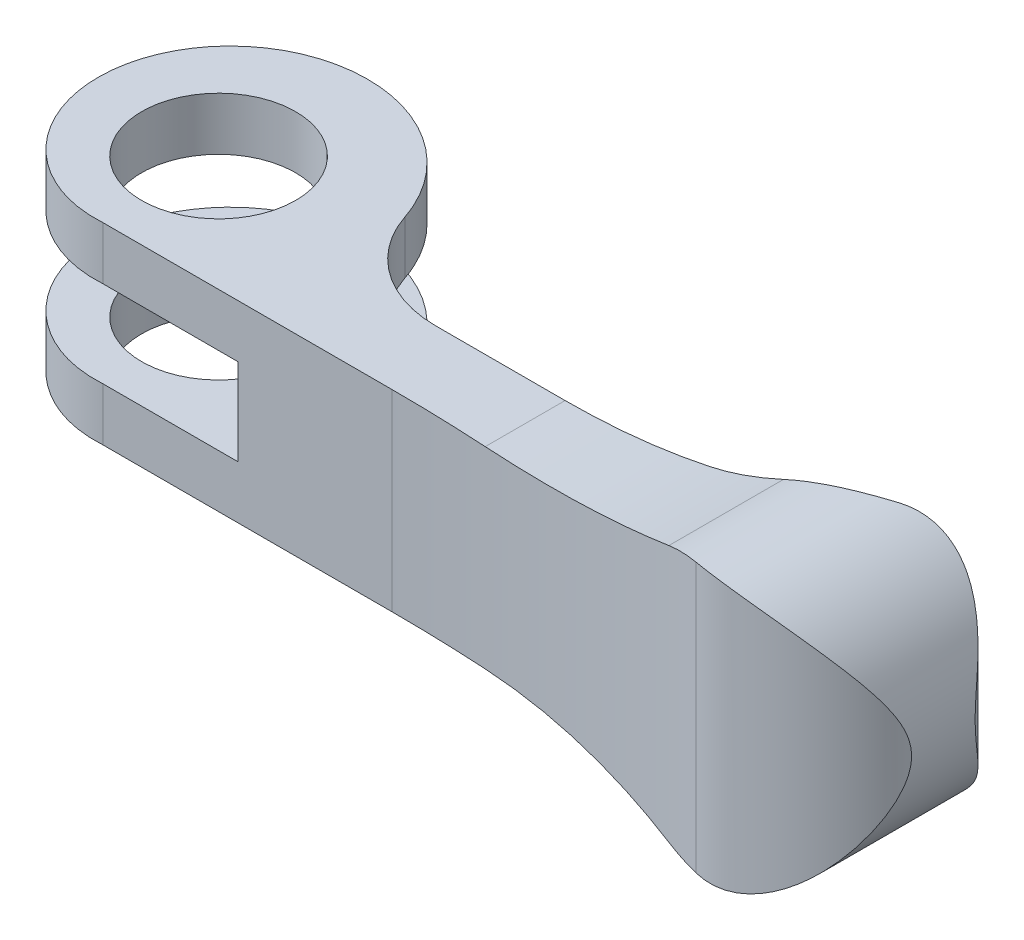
ISO-10303-21;
HEADER;
FILE_DESCRIPTION(('STEP AP214'),'2;1');
FILE_NAME('part.step','',(''),(''),'','','');
FILE_SCHEMA(('AUTOMOTIVE_DESIGN { 1 0 10303 214 1 1 1 1 }'));
ENDSEC;
DATA;
#1=APPLICATION_CONTEXT('core data for automotive mechanical design processes');
#2=APPLICATION_PROTOCOL_DEFINITION('international standard','automotive_design',2000,#1);
#3=PRODUCT_CONTEXT('',#1,'mechanical');
#4=PRODUCT('Part','Part','',(#3));
#5=PRODUCT_RELATED_PRODUCT_CATEGORY('part','',(#4));
#6=PRODUCT_DEFINITION_FORMATION('','',#4);
#7=PRODUCT_DEFINITION_CONTEXT('part definition',#1,'design');
#8=PRODUCT_DEFINITION('design','',#6,#7);
#9=PRODUCT_DEFINITION_SHAPE('','',#8);
#10=(LENGTH_UNIT() NAMED_UNIT(*) SI_UNIT(.MILLI.,.METRE.));
#11=(NAMED_UNIT(*) PLANE_ANGLE_UNIT() SI_UNIT($,.RADIAN.));
#12=(NAMED_UNIT(*) SI_UNIT($,.STERADIAN.) SOLID_ANGLE_UNIT());
#13=UNCERTAINTY_MEASURE_WITH_UNIT(LENGTH_MEASURE(1.E-05),#10,'distance_accuracy_value','');
#14=(GEOMETRIC_REPRESENTATION_CONTEXT(3) GLOBAL_UNCERTAINTY_ASSIGNED_CONTEXT((#13)) GLOBAL_UNIT_ASSIGNED_CONTEXT((#10,
#11,#12)) REPRESENTATION_CONTEXT('',''));
#15=CARTESIAN_POINT('',(0.,0.,0.));
#16=DIRECTION('',(0.,0.,1.));
#17=DIRECTION('',(1.,0.,0.));
#18=AXIS2_PLACEMENT_3D('',#15,#16,#17);
#19=CARTESIAN_POINT('',(15.,-7.,90.75));
#20=DIRECTION('',(0.,1.,0.));
#21=DIRECTION('',(1.,0.,0.));
#22=AXIS2_PLACEMENT_3D('',#19,#20,#21);
#23=CYLINDRICAL_SURFACE('',#22,84.75);
#24=CARTESIAN_POINT('',(30.8959537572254,6.67630057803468,7.50409226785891));
#25=CARTESIAN_POINT('',(31.0384123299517,6.72120307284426,7.53129297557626));
#26=CARTESIAN_POINT('',(31.182197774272,6.76149824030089,7.5591300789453));
#27=CARTESIAN_POINT('',(31.4712555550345,6.83264115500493,7.61588085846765));
#28=CARTESIAN_POINT('',(31.6165197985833,6.86352550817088,7.64478985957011));
#29=CARTESIAN_POINT('',(31.9084994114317,6.91596904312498,7.70370371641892));
#30=CARTESIAN_POINT('',(32.0552147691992,6.93752829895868,7.7337085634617));
#31=CARTESIAN_POINT('',(32.3500956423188,6.97135251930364,7.79483420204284));
#32=CARTESIAN_POINT('',(32.498264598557,6.98358037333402,7.82595893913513));
#33=CARTESIAN_POINT('',(32.6465753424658,6.99107223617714,7.85753424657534));
#34=B_SPLINE_CURVE_WITH_KNOTS('',3,(#24,#25,#26,#27,#28,#29,#30,#31,#32,#33),.UNSPECIFIED.,.F.,
.F.,(4,2,2,2,4),(0.,0.455390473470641,0.908986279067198,1.36257848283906,1.8179653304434),.UNSPECIFIED.);
#35=CARTESIAN_POINT('',(30.8959537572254,6.67630057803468,7.50409226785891));
#36=VERTEX_POINT('',#35);
#37=CARTESIAN_POINT('',(32.6465753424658,6.99107223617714,7.85753424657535));
#38=VERTEX_POINT('',#37);
#39=EDGE_CURVE('E179',#36,#38,#34,.T.);
#40=ORIENTED_EDGE('',*,*,#39,.F.);
#41=CARTESIAN_POINT('',(20.,5.,6.14762119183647));
#42=CARTESIAN_POINT('',(20.4656564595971,4.99999748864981,6.17513663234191));
#43=CARTESIAN_POINT('',(20.9310331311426,5.00897368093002,6.20650412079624));
#44=CARTESIAN_POINT('',(21.860510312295,5.04478911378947,6.2768504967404));
#45=CARTESIAN_POINT('',(22.3246108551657,5.0716278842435,6.31582918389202));
#46=CARTESIAN_POINT('',(23.7076390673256,5.17830965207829,6.44346213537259));
#47=CARTESIAN_POINT('',(24.6236680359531,5.28432229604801,6.54319205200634));
#48=CARTESIAN_POINT('',(26.4414941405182,5.56505184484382,6.77087232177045));
#49=CARTESIAN_POINT('',(27.3432919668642,5.73976540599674,6.89882130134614));
#50=CARTESIAN_POINT('',(28.6840028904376,6.05251039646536,7.11078996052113));
#51=CARTESIAN_POINT('',(29.1304089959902,6.16567755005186,7.18507473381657));
#52=CARTESIAN_POINT('',(30.0175613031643,6.40861020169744,7.33993963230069));
#53=CARTESIAN_POINT('',(30.4583077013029,6.53837512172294,7.42051953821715));
#54=CARTESIAN_POINT('',(30.8959537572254,6.67630057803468,7.50409226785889));
#55=B_SPLINE_CURVE_WITH_KNOTS('',3,(#41,#42,#43,#44,#45,#46,#47,#48,#49,#50,#51,#52,#53,#54),
.UNSPECIFIED.,.F.,.F.,(4,2,2,2,2,2,4),(0.,1.39920156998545,2.7983663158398,5.57759832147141,
8.35669507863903,9.7558093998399,11.1548750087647),.UNSPECIFIED.);
#56=CARTESIAN_POINT('',(20.,5.,6.14762119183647));
#57=VERTEX_POINT('',#56);
#58=EDGE_CURVE('E145',#57,#36,#55,.T.);
#59=ORIENTED_EDGE('',*,*,#58,.F.);
#60=CARTESIAN_POINT('',(15.,5.,90.75));
#61=DIRECTION('',(0.,1.,0.));
#62=DIRECTION('',(1.,0.,0.));
#63=AXIS2_PLACEMENT_3D('',#60,#61,#62);
#64=CIRCLE('',#63,84.75);
#65=CARTESIAN_POINT('',(15.,5.,6.));
#66=VERTEX_POINT('',#65);
#67=EDGE_CURVE('E154',#66,#57,#64,.F.);
#68=ORIENTED_EDGE('',*,*,#67,.F.);
#69=DIRECTION('',(0.,1.,0.));
#70=VECTOR('',#69,1.);
#71=CARTESIAN_POINT('',(15.,-7.,6.));
#72=LINE('',#71,#70);
#73=CARTESIAN_POINT('',(15.,-5.,6.));
#74=VERTEX_POINT('',#73);
#75=EDGE_CURVE('E303',#74,#66,#72,.T.);
#76=ORIENTED_EDGE('',*,*,#75,.F.);
#77=CARTESIAN_POINT('',(15.,-5.,90.75));
#78=DIRECTION('',(0.,1.,0.));
#79=DIRECTION('',(1.,0.,0.));
#80=AXIS2_PLACEMENT_3D('',#77,#78,#79);
#81=CIRCLE('',#80,84.75);
#82=CARTESIAN_POINT('',(20.,-5.,6.14762119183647));
#83=VERTEX_POINT('',#82);
#84=EDGE_CURVE('E558',#74,#83,#81,.F.);
#85=ORIENTED_EDGE('',*,*,#84,.T.);
#86=CARTESIAN_POINT('',(20.,-5.,6.14762119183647));
#87=CARTESIAN_POINT('',(20.4656564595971,-4.99999748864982,6.17513663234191));
#88=CARTESIAN_POINT('',(20.9310331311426,-5.00897368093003,6.20650412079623));
#89=CARTESIAN_POINT('',(21.860510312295,-5.04478911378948,6.27685049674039));
#90=CARTESIAN_POINT('',(22.3246108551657,-5.07162788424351,6.31582918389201));
#91=CARTESIAN_POINT('',(23.7076390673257,-5.1783096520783,6.44346213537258));
#92=CARTESIAN_POINT('',(24.6236680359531,-5.28432229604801,6.54319205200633));
#93=CARTESIAN_POINT('',(26.4414941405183,-5.56505184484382,6.77087232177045));
#94=CARTESIAN_POINT('',(27.3432919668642,-5.73976540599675,6.89882130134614));
#95=CARTESIAN_POINT('',(28.6840028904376,-6.05251039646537,7.11078996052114));
#96=CARTESIAN_POINT('',(29.1304089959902,-6.16567755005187,7.18507473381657));
#97=CARTESIAN_POINT('',(30.0175613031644,-6.40861020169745,7.33993963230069));
#98=CARTESIAN_POINT('',(30.4583077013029,-6.53837512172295,7.42051953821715));
#99=CARTESIAN_POINT('',(30.8959537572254,-6.67630057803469,7.50409226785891));
#100=B_SPLINE_CURVE_WITH_KNOTS('',3,(#86,#87,#88,#89,#90,#91,#92,#93,#94,#95,#96,#97,#98,#99),
.UNSPECIFIED.,.F.,.F.,(4,2,2,2,2,2,4),(0.,1.39920156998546,2.79836631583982,5.57759832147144,
8.35669507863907,9.75580939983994,11.1548750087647),.UNSPECIFIED.);
#101=CARTESIAN_POINT('',(30.8959537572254,-6.67630057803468,7.50409226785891));
#102=VERTEX_POINT('',#101);
#103=EDGE_CURVE('E541',#83,#102,#100,.T.);
#104=ORIENTED_EDGE('',*,*,#103,.T.);
#105=CARTESIAN_POINT('',(30.8959537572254,-6.67630057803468,7.50409226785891));
#106=CARTESIAN_POINT('',(31.0384123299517,-6.72120307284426,7.53129297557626));
#107=CARTESIAN_POINT('',(31.182197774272,-6.76149824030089,7.5591300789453));
#108=CARTESIAN_POINT('',(31.4712555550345,-6.83264115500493,7.61588085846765));
#109=CARTESIAN_POINT('',(31.6165197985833,-6.86352550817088,7.64478985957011));
#110=CARTESIAN_POINT('',(31.9084994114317,-6.91596904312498,7.70370371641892));
#111=CARTESIAN_POINT('',(32.0552147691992,-6.93752829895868,7.7337085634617));
#112=CARTESIAN_POINT('',(32.3500956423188,-6.97135251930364,7.79483420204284));
#113=CARTESIAN_POINT('',(32.498264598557,-6.98358037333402,7.82595893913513));
#114=CARTESIAN_POINT('',(32.6465753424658,-6.99107223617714,7.85753424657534));
#115=B_SPLINE_CURVE_WITH_KNOTS('',3,(#105,#106,#107,#108,#109,#110,#111,#112,#113,#114),
.UNSPECIFIED.,.F.,.F.,(4,2,2,2,4),(0.,0.455390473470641,0.908986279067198,1.36257848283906,
1.8179653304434),.UNSPECIFIED.);
#116=CARTESIAN_POINT('',(32.6465753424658,-6.99107223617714,7.85753424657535));
#117=VERTEX_POINT('',#116);
#118=EDGE_CURVE('E222',#102,#117,#115,.T.);
#119=ORIENTED_EDGE('',*,*,#118,.T.);
#120=DIRECTION('',(0.,1.,0.));
#121=VECTOR('',#120,1.);
#122=CARTESIAN_POINT('',(32.6465753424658,-7.,7.85753424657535));
#123=LINE('',#122,#121);
#124=EDGE_CURVE('E286',#117,#38,#123,.T.);
#125=ORIENTED_EDGE('',*,*,#124,.T.);
#126=EDGE_LOOP('',(#40,#59,#68,#76,#85,#104,#119,#125));
#127=FACE_BOUND('',#126,.T.);
#128=ADVANCED_FACE('F14',(#127),#23,.F.);
#129=CARTESIAN_POINT('',(0.,-7.,6.));
#130=DIRECTION('',(0.,0.,-1.));
#131=DIRECTION('',(1.,0.,0.));
#132=AXIS2_PLACEMENT_3D('',#129,#130,#131);
#133=PLANE('',#132);
#134=DIRECTION('',(1.,0.,0.));
#135=VECTOR('',#134,1.);
#136=CARTESIAN_POINT('',(0.,5.,6.));
#137=LINE('',#136,#135);
#138=CARTESIAN_POINT('',(0.,5.,6.));
#139=VERTEX_POINT('',#138);
#140=EDGE_CURVE('E164',#139,#66,#137,.T.);
#141=ORIENTED_EDGE('',*,*,#140,.F.);
#142=DIRECTION('',(0.,1.,0.));
#143=VECTOR('',#142,1.);
#144=CARTESIAN_POINT('',(0.,-7.,6.));
#145=LINE('',#144,#143);
#146=CARTESIAN_POINT('',(0.,2.25,6.));
#147=VERTEX_POINT('',#146);
#148=EDGE_CURVE('E294',#147,#139,#145,.T.);
#149=ORIENTED_EDGE('',*,*,#148,.F.);
#150=DIRECTION('',(1.,0.,0.));
#151=VECTOR('',#150,1.);
#152=CARTESIAN_POINT('',(0.,2.25,6.));
#153=LINE('',#152,#151);
#154=CARTESIAN_POINT('',(7.,2.25,6.));
#155=VERTEX_POINT('',#154);
#156=EDGE_CURVE('E42',#147,#155,#153,.T.);
#157=ORIENTED_EDGE('',*,*,#156,.T.);
#158=DIRECTION('',(0.,-1.,0.));
#159=VECTOR('',#158,1.);
#160=CARTESIAN_POINT('',(7.,-7.,6.));
#161=LINE('',#160,#159);
#162=CARTESIAN_POINT('',(7.,-2.25,6.));
#163=VERTEX_POINT('',#162);
#164=EDGE_CURVE('E367',#155,#163,#161,.T.);
#165=ORIENTED_EDGE('',*,*,#164,.T.);
#166=DIRECTION('',(-1.,0.,0.));
#167=VECTOR('',#166,1.);
#168=CARTESIAN_POINT('',(0.,-2.25,6.));
#169=LINE('',#168,#167);
#170=CARTESIAN_POINT('',(0.,-2.25,6.));
#171=VERTEX_POINT('',#170);
#172=EDGE_CURVE('E361',#163,#171,#169,.T.);
#173=ORIENTED_EDGE('',*,*,#172,.T.);
#174=CARTESIAN_POINT('',(0.,-5.,6.));
#175=VERTEX_POINT('',#174);
#176=EDGE_CURVE('E298',#175,#171,#145,.T.);
#177=ORIENTED_EDGE('',*,*,#176,.F.);
#178=DIRECTION('',(1.,0.,0.));
#179=VECTOR('',#178,1.);
#180=CARTESIAN_POINT('',(0.,-5.,6.));
#181=LINE('',#180,#179);
#182=EDGE_CURVE('E543',#175,#74,#181,.T.);
#183=ORIENTED_EDGE('',*,*,#182,.T.);
#184=ORIENTED_EDGE('',*,*,#75,.T.);
#185=EDGE_LOOP('',(#141,#149,#157,#165,#173,#177,#183,#184));
#186=FACE_BOUND('',#185,.T.);
#187=ADVANCED_FACE('F274',(#186),#133,.F.);
#188=CARTESIAN_POINT('',(0.,-7.,6.));
#189=CARTESIAN_POINT('',(-0.785398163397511,-7.,6.05491666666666));
#190=CARTESIAN_POINT('',(-1.59259457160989,-7.,5.95356167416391));
#191=CARTESIAN_POINT('',(-3.12570080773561,-7.,5.43741102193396));
#192=CARTESIAN_POINT('',(-3.85094151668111,-7.,5.02265933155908));
#193=CARTESIAN_POINT('',(-5.10032322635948,-7.,3.92860541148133));
#194=CARTESIAN_POINT('',(-5.6238508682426,-7.,3.24961186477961));
#195=CARTESIAN_POINT('',(-6.3759584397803,-7.,1.72087189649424));
#196=CARTESIAN_POINT('',(-6.60408333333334,-7.,0.871661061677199));
#197=CARTESIAN_POINT('',(-6.71391666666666,-7.,-0.871661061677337));
#198=CARTESIAN_POINT('',(-6.59540966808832,-7.,-1.76508642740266));
#199=CARTESIAN_POINT('',(-6.01323625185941,-7.,-3.45758571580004));
#200=CARTESIAN_POINT('',(-5.54963978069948,-7.,-4.25592780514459));
#201=CARTESIAN_POINT('',(-4.33359169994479,-7.,-5.62730367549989));
#202=CARTESIAN_POINT('',(-3.58149677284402,-7.,-6.19967609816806));
#203=CARTESIAN_POINT('',(-1.893363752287,-7.,-7.01780643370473));
#204=CARTESIAN_POINT('',(-0.957923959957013,-7.,-7.26308333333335));
#205=CARTESIAN_POINT('',(0.957923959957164,-7.,-7.37291666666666));
#206=CARTESIAN_POINT('',(1.93757828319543,-7.,-7.23725766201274));
#207=CARTESIAN_POINT('',(3.78947062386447,-7.,-6.58906148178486));
#208=CARTESIAN_POINT('',(4.66091409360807,-7.,-6.07662022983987));
#209=CARTESIAN_POINT('',(6.1542841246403,-7.,-4.73857798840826));
#210=CARTESIAN_POINT('',(6.77550132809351,-7.,-3.91338168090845));
#211=CARTESIAN_POINT('',(7.65965442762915,-7.,-2.06585560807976));
#212=CARTESIAN_POINT('',(7.92208333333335,-7.,-1.04418685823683));
#213=CARTESIAN_POINT('',(8.03191666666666,-7.,1.04418685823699));
#214=CARTESIAN_POINT('',(7.87910565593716,-7.,2.1100701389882));
#215=CARTESIAN_POINT('',(7.16488671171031,-7.,4.1213555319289));
#216=CARTESIAN_POINT('',(6.60360067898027,-7.,5.06590038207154));
#217=CARTESIAN_POINT('',(5.14356427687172,-7.,6.6812645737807));
#218=CARTESIAN_POINT('',(4.24526658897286,-7.,7.35132655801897));
#219=CARTESIAN_POINT('',(2.23834746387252,-7.,8.30150242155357));
#220=CARTESIAN_POINT('',(1.13044975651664,-7.,8.58108333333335));
#221=CARTESIAN_POINT('',(0.,-7.,8.636));
#222=B_SPLINE_CURVE_WITH_KNOTS('',3,(#188,#189,#190,#191,#192,#193,#194,#195,#196,#197,#198,
#199,#200,#201,#202,#203,#204,#205,#206,#207,#208,#209,#210,#211,#212,#213,#214,#215,#216,#217,
#218,#219,#220,#221),.UNSPECIFIED.,.F.,.F.,(4,2,2,2,2,2,2,2,2,2,2,2,2,2,2,2,4),(0.,0.0625,0.125,
0.1875,0.25,0.3125,0.375,0.4375,0.5,0.5625,0.625,0.6875,0.75,0.8125,0.875,0.9375,1.),.UNSPECIFIED.);
#223=DIRECTION('',(0.,1.,0.));
#224=VECTOR('',#223,1.);
#225=SURFACE_OF_LINEAR_EXTRUSION('',#222,#224);
#226=CARTESIAN_POINT('',(0.,5.,6.));
#227=CARTESIAN_POINT('',(-0.785398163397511,5.,6.05491666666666));
#228=CARTESIAN_POINT('',(-1.59259457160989,5.,5.95356167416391));
#229=CARTESIAN_POINT('',(-3.12570080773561,5.,5.43741102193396));
#230=CARTESIAN_POINT('',(-3.85094151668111,5.,5.02265933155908));
#231=CARTESIAN_POINT('',(-5.10032322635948,5.,3.92860541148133));
#232=CARTESIAN_POINT('',(-5.6238508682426,5.,3.24961186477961));
#233=CARTESIAN_POINT('',(-6.3759584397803,5.,1.72087189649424));
#234=CARTESIAN_POINT('',(-6.60408333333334,5.,0.871661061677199));
#235=CARTESIAN_POINT('',(-6.71391666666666,5.,-0.871661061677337));
#236=CARTESIAN_POINT('',(-6.59540966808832,5.,-1.76508642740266));
#237=CARTESIAN_POINT('',(-6.01323625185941,5.,-3.45758571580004));
#238=CARTESIAN_POINT('',(-5.54963978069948,5.,-4.25592780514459));
#239=CARTESIAN_POINT('',(-4.33359169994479,5.,-5.62730367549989));
#240=CARTESIAN_POINT('',(-3.58149677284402,5.,-6.19967609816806));
#241=CARTESIAN_POINT('',(-1.893363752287,5.,-7.01780643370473));
#242=CARTESIAN_POINT('',(-0.957923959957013,5.,-7.26308333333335));
#243=CARTESIAN_POINT('',(0.957923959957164,5.,-7.37291666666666));
#244=CARTESIAN_POINT('',(1.93757828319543,5.,-7.23725766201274));
#245=CARTESIAN_POINT('',(3.78947062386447,5.,-6.58906148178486));
#246=CARTESIAN_POINT('',(4.66091409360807,5.,-6.07662022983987));
#247=CARTESIAN_POINT('',(6.1542841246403,5.,-4.73857798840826));
#248=CARTESIAN_POINT('',(6.77550132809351,5.,-3.91338168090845));
#249=CARTESIAN_POINT('',(7.65965442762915,5.,-2.06585560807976));
#250=CARTESIAN_POINT('',(7.92208333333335,5.,-1.04418685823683));
#251=CARTESIAN_POINT('',(8.03191666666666,5.,1.04418685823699));
#252=CARTESIAN_POINT('',(7.87910565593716,5.,2.1100701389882));
#253=CARTESIAN_POINT('',(7.16488671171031,5.,4.1213555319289));
#254=CARTESIAN_POINT('',(6.60360067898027,5.,5.06590038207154));
#255=CARTESIAN_POINT('',(5.14356427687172,5.,6.6812645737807));
#256=CARTESIAN_POINT('',(4.24526658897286,5.,7.35132655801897));
#257=CARTESIAN_POINT('',(2.23834746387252,5.,8.30150242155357));
#258=CARTESIAN_POINT('',(1.13044975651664,5.,8.58108333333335));
#259=CARTESIAN_POINT('',(0.,5.,8.636));
#260=B_SPLINE_CURVE_WITH_KNOTS('',3,(#226,#227,#228,#229,#230,#231,#232,#233,#234,#235,#236,
#237,#238,#239,#240,#241,#242,#243,#244,#245,#246,#247,#248,#249,#250,#251,#252,#253,#254,#255,
#256,#257,#258,#259),.UNSPECIFIED.,.F.,.F.,(4,2,2,2,2,2,2,2,2,2,2,2,2,2,2,2,4),(0.,0.0625,0.125,
0.1875,0.25,0.3125,0.375,0.4375,0.5,0.5625,0.625,0.6875,0.75,0.8125,0.875,0.9375,1.),.UNSPECIFIED.);
#261=CARTESIAN_POINT('',(7.57871796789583,5.,-2.09668552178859));
#262=VERTEX_POINT('',#261);
#263=EDGE_CURVE('E162',#262,#139,#260,.F.);
#264=ORIENTED_EDGE('',*,*,#263,.F.);
#265=DIRECTION('',(0.,1.,0.));
#266=VECTOR('',#265,1.);
#267=CARTESIAN_POINT('',(7.57871796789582,7.,-2.09668552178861));
#268=LINE('',#267,#266);
#269=CARTESIAN_POINT('',(7.57871796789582,2.25,-2.09668552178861));
#270=VERTEX_POINT('',#269);
#271=EDGE_CURVE('E35',#262,#270,#268,.F.);
#272=ORIENTED_EDGE('',*,*,#271,.T.);
#273=CARTESIAN_POINT('',(0.,2.25,6.));
#274=CARTESIAN_POINT('',(-0.785398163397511,2.25,6.05491666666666));
#275=CARTESIAN_POINT('',(-1.59259457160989,2.25,5.95356167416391));
#276=CARTESIAN_POINT('',(-3.12570080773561,2.25,5.43741102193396));
#277=CARTESIAN_POINT('',(-3.85094151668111,2.25,5.02265933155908));
#278=CARTESIAN_POINT('',(-5.10032322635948,2.25,3.92860541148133));
#279=CARTESIAN_POINT('',(-5.6238508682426,2.25,3.24961186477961));
#280=CARTESIAN_POINT('',(-6.3759584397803,2.25,1.72087189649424));
#281=CARTESIAN_POINT('',(-6.60408333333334,2.25,0.871661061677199));
#282=CARTESIAN_POINT('',(-6.71391666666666,2.25,-0.871661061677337));
#283=CARTESIAN_POINT('',(-6.59540966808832,2.25,-1.76508642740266));
#284=CARTESIAN_POINT('',(-6.01323625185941,2.25,-3.45758571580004));
#285=CARTESIAN_POINT('',(-5.54963978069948,2.25,-4.25592780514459));
#286=CARTESIAN_POINT('',(-4.33359169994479,2.25,-5.62730367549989));
#287=CARTESIAN_POINT('',(-3.58149677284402,2.25,-6.19967609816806));
#288=CARTESIAN_POINT('',(-1.893363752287,2.25,-7.01780643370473));
#289=CARTESIAN_POINT('',(-0.957923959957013,2.25,-7.26308333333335));
#290=CARTESIAN_POINT('',(0.957923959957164,2.25,-7.37291666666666));
#291=CARTESIAN_POINT('',(1.93757828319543,2.25,-7.23725766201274));
#292=CARTESIAN_POINT('',(3.78947062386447,2.25,-6.58906148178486));
#293=CARTESIAN_POINT('',(4.66091409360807,2.25,-6.07662022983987));
#294=CARTESIAN_POINT('',(6.1542841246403,2.25,-4.73857798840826));
#295=CARTESIAN_POINT('',(6.77550132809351,2.25,-3.91338168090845));
#296=CARTESIAN_POINT('',(7.65965442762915,2.25,-2.06585560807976));
#297=CARTESIAN_POINT('',(7.92208333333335,2.25,-1.04418685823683));
#298=CARTESIAN_POINT('',(8.03191666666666,2.25,1.04418685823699));
#299=CARTESIAN_POINT('',(7.87910565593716,2.25,2.1100701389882));
#300=CARTESIAN_POINT('',(7.16488671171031,2.25,4.1213555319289));
#301=CARTESIAN_POINT('',(6.60360067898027,2.25,5.06590038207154));
#302=CARTESIAN_POINT('',(5.14356427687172,2.25,6.6812645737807));
#303=CARTESIAN_POINT('',(4.24526658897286,2.25,7.35132655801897));
#304=CARTESIAN_POINT('',(2.23834746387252,2.25,8.30150242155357));
#305=CARTESIAN_POINT('',(1.13044975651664,2.25,8.58108333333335));
#306=CARTESIAN_POINT('',(0.,2.25,8.636));
#307=B_SPLINE_CURVE_WITH_KNOTS('',3,(#273,#274,#275,#276,#277,#278,#279,#280,#281,#282,#283,
#284,#285,#286,#287,#288,#289,#290,#291,#292,#293,#294,#295,#296,#297,#298,#299,#300,#301,#302,
#303,#304,#305,#306),.UNSPECIFIED.,.F.,.F.,(4,2,2,2,2,2,2,2,2,2,2,2,2,2,2,2,4),(0.,0.0625,0.125,
0.1875,0.25,0.3125,0.375,0.4375,0.5,0.5625,0.625,0.6875,0.75,0.8125,0.875,0.9375,1.),.UNSPECIFIED.);
#308=EDGE_CURVE('E309',#270,#147,#307,.F.);
#309=ORIENTED_EDGE('',*,*,#308,.T.);
#310=ORIENTED_EDGE('',*,*,#148,.T.);
#311=EDGE_LOOP('',(#264,#272,#309,#310));
#312=FACE_BOUND('',#311,.T.);
#313=ADVANCED_FACE('F280',(#312),#225,.F.);
#314=CARTESIAN_POINT('',(7.83009886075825,-7.,2.));
#315=DIRECTION('',(0.,0.,1.));
#316=DIRECTION('',(-1.,0.,0.));
#317=AXIS2_PLACEMENT_3D('',#314,#315,#316);
#318=PLANE('',#317);
#319=CARTESIAN_POINT('',(20.,41.25,2.));
#320=DIRECTION('',(0.,0.,1.));
#321=DIRECTION('',(-1.,0.,0.));
#322=AXIS2_PLACEMENT_3D('',#319,#320,#321);
#323=CIRCLE('',#322,36.25);
#324=CARTESIAN_POINT('',(27.5131670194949,5.78713461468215,2.));
#325=VERTEX_POINT('',#324);
#326=CARTESIAN_POINT('',(20.,5.,2.));
#327=VERTEX_POINT('',#326);
#328=EDGE_CURVE('E134',#325,#327,#323,.F.);
#329=ORIENTED_EDGE('',*,*,#328,.F.);
#330=DIRECTION('',(0.,1.,0.));
#331=VECTOR('',#330,1.);
#332=CARTESIAN_POINT('',(27.5131670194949,-7.,2.));
#333=LINE('',#332,#331);
#334=CARTESIAN_POINT('',(27.5131670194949,-5.78713461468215,2.));
#335=VERTEX_POINT('',#334);
#336=EDGE_CURVE('E290',#335,#325,#333,.T.);
#337=ORIENTED_EDGE('',*,*,#336,.F.);
#338=CARTESIAN_POINT('',(20.,-41.25,2.));
#339=DIRECTION('',(0.,0.,1.));
#340=DIRECTION('',(-1.,0.,0.));
#341=AXIS2_PLACEMENT_3D('',#338,#339,#340);
#342=CIRCLE('',#341,36.25);
#343=CARTESIAN_POINT('',(20.,-5.,2.));
#344=VERTEX_POINT('',#343);
#345=EDGE_CURVE('E257',#335,#344,#342,.T.);
#346=ORIENTED_EDGE('',*,*,#345,.T.);
#347=DIRECTION('',(-1.,0.,0.));
#348=VECTOR('',#347,1.);
#349=CARTESIAN_POINT('',(7.83009886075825,-5.,2.));
#350=LINE('',#349,#348);
#351=CARTESIAN_POINT('',(13.2688316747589,-5.,2.));
#352=VERTEX_POINT('',#351);
#353=EDGE_CURVE('E330',#344,#352,#350,.T.);
#354=ORIENTED_EDGE('',*,*,#353,.T.);
#355=DIRECTION('',(0.,-1.,0.));
#356=VECTOR('',#355,1.);
#357=CARTESIAN_POINT('',(13.2688316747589,7.,2.));
#358=LINE('',#357,#356);
#359=CARTESIAN_POINT('',(13.2688316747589,-2.25,2.));
#360=VERTEX_POINT('',#359);
#361=EDGE_CURVE('E315',#352,#360,#358,.F.);
#362=ORIENTED_EDGE('',*,*,#361,.T.);
#363=DIRECTION('',(-1.,0.,0.));
#364=VECTOR('',#363,1.);
#365=CARTESIAN_POINT('',(17.,-2.25,2.));
#366=LINE('',#365,#364);
#367=CARTESIAN_POINT('',(7.,-2.25,2.));
#368=VERTEX_POINT('',#367);
#369=EDGE_CURVE('E341',#360,#368,#366,.T.);
#370=ORIENTED_EDGE('',*,*,#369,.T.);
#371=DIRECTION('',(0.,1.,0.));
#372=VECTOR('',#371,1.);
#373=CARTESIAN_POINT('',(7.,-2.25,2.));
#374=LINE('',#373,#372);
#375=CARTESIAN_POINT('',(7.,2.25,2.));
#376=VERTEX_POINT('',#375);
#377=EDGE_CURVE('E339',#368,#376,#374,.T.);
#378=ORIENTED_EDGE('',*,*,#377,.T.);
#379=DIRECTION('',(-1.,0.,0.));
#380=VECTOR('',#379,1.);
#381=CARTESIAN_POINT('',(17.,2.25,2.));
#382=LINE('',#381,#380);
#383=CARTESIAN_POINT('',(13.2688316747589,2.25,2.));
#384=VERTEX_POINT('',#383);
#385=EDGE_CURVE('E336',#384,#376,#382,.T.);
#386=ORIENTED_EDGE('',*,*,#385,.F.);
#387=CARTESIAN_POINT('',(13.2688316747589,5.,2.00000000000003));
#388=VERTEX_POINT('',#387);
#389=EDGE_CURVE('E161',#384,#388,#358,.F.);
#390=ORIENTED_EDGE('',*,*,#389,.T.);
#391=DIRECTION('',(-1.,0.,0.));
#392=VECTOR('',#391,1.);
#393=CARTESIAN_POINT('',(7.83009886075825,5.,2.));
#394=LINE('',#393,#392);
#395=EDGE_CURVE('E151',#327,#388,#394,.T.);
#396=ORIENTED_EDGE('',*,*,#395,.F.);
#397=EDGE_LOOP('',(#329,#337,#346,#354,#362,#370,#378,#386,#390,#396));
#398=FACE_BOUND('',#397,.T.);
#399=ADVANCED_FACE('F158',(#398),#318,.F.);
#400=CARTESIAN_POINT('',(27.5131670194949,-7.,-11.));
#401=DIRECTION('',(0.,1.,0.));
#402=DIRECTION('',(1.,0.,0.));
#403=AXIS2_PLACEMENT_3D('',#400,#401,#402);
#404=CYLINDRICAL_SURFACE('',#403,13.);
#405=CARTESIAN_POINT('',(34.9876414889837,6.71187613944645,-0.363636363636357));
#406=CARTESIAN_POINT('',(34.8187103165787,6.7619111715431,-0.244891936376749));
#407=CARTESIAN_POINT('',(34.645708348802,6.80619685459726,-0.129362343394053));
#408=CARTESIAN_POINT('',(34.2921746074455,6.8820770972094,0.0945349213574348));
#409=CARTESIAN_POINT('',(34.1116346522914,6.9136574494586,0.202894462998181));
#410=CARTESIAN_POINT('',(33.7491024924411,6.9621374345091,0.40856565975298));
#411=CARTESIAN_POINT('',(33.5672886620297,6.97941906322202,0.506100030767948));
#412=CARTESIAN_POINT('',(33.1986366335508,6.99961375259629,0.692649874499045));
#413=CARTESIAN_POINT('',(33.0118009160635,7.0025337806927,0.781669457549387));
#414=CARTESIAN_POINT('',(32.6668262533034,6.99381458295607,0.936043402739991));
#415=CARTESIAN_POINT('',(32.5092671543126,6.98458871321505,1.00283690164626));
#416=CARTESIAN_POINT('',(32.1925327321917,6.95509121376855,1.12982479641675));
#417=CARTESIAN_POINT('',(32.0333575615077,6.93482061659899,1.19001980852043));
#418=CARTESIAN_POINT('',(31.7107197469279,6.88222774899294,1.30489732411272));
#419=CARTESIAN_POINT('',(31.5472434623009,6.84963623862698,1.35941912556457));
#420=CARTESIAN_POINT('',(31.2208467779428,6.77221236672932,1.46124184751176));
#421=CARTESIAN_POINT('',(31.0579267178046,6.72737354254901,1.50853893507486));
#422=CARTESIAN_POINT('',(30.8959537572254,6.67630057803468,1.55216132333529));
#423=B_SPLINE_CURVE_WITH_KNOTS('',3,(#405,#406,#407,#408,#409,#410,#411,#412,#413,#414,#415,
#416,#417,#418,#419,#420,#421,#422),.UNSPECIFIED.,.F.,.F.,(4,2,2,2,2,2,2,2,4),(0.,
0.637386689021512,1.27548414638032,1.89592745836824,2.51606973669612,3.02975109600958,
3.5433844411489,4.06895957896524,4.59481258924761),.UNSPECIFIED.);
#424=CARTESIAN_POINT('',(34.9876414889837,6.71187613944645,-0.363636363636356));
#425=VERTEX_POINT('',#424);
#426=CARTESIAN_POINT('',(30.8959537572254,6.67630057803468,1.55216132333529));
#427=VERTEX_POINT('',#426);
#428=EDGE_CURVE('E146',#425,#427,#423,.T.);
#429=ORIENTED_EDGE('',*,*,#428,.F.);
#430=DIRECTION('',(0.,1.,0.));
#431=VECTOR('',#430,1.);
#432=CARTESIAN_POINT('',(34.9876414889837,-7.,-0.363636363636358));
#433=LINE('',#432,#431);
#434=CARTESIAN_POINT('',(34.9876414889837,-6.71187613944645,-0.363636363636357));
#435=VERTEX_POINT('',#434);
#436=EDGE_CURVE('E295',#435,#425,#433,.T.);
#437=ORIENTED_EDGE('',*,*,#436,.F.);
#438=CARTESIAN_POINT('',(34.9876414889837,-6.71187613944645,-0.363636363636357));
#439=CARTESIAN_POINT('',(34.8187103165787,-6.7619111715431,-0.244891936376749));
#440=CARTESIAN_POINT('',(34.645708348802,-6.80619685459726,-0.129362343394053));
#441=CARTESIAN_POINT('',(34.2921746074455,-6.8820770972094,0.0945349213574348));
#442=CARTESIAN_POINT('',(34.1116346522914,-6.9136574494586,0.202894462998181));
#443=CARTESIAN_POINT('',(33.7491024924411,-6.9621374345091,0.40856565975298));
#444=CARTESIAN_POINT('',(33.5672886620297,-6.97941906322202,0.506100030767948));
#445=CARTESIAN_POINT('',(33.1986366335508,-6.99961375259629,0.692649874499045));
#446=CARTESIAN_POINT('',(33.0118009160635,-7.0025337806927,0.781669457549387));
#447=CARTESIAN_POINT('',(32.6668262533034,-6.99381458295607,0.936043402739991));
#448=CARTESIAN_POINT('',(32.5092671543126,-6.98458871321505,1.00283690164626));
#449=CARTESIAN_POINT('',(32.1925327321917,-6.95509121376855,1.12982479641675));
#450=CARTESIAN_POINT('',(32.0333575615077,-6.93482061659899,1.19001980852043));
#451=CARTESIAN_POINT('',(31.7107197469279,-6.88222774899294,1.30489732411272));
#452=CARTESIAN_POINT('',(31.5472434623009,-6.84963623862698,1.35941912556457));
#453=CARTESIAN_POINT('',(31.2208467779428,-6.77221236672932,1.46124184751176));
#454=CARTESIAN_POINT('',(31.0579267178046,-6.72737354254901,1.50853893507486));
#455=CARTESIAN_POINT('',(30.8959537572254,-6.67630057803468,1.55216132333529));
#456=B_SPLINE_CURVE_WITH_KNOTS('',3,(#438,#439,#440,#441,#442,#443,#444,#445,#446,#447,#448,
#449,#450,#451,#452,#453,#454,#455),.UNSPECIFIED.,.F.,.F.,(4,2,2,2,2,2,2,2,4),(0.,
0.637386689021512,1.27548414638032,1.89592745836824,2.51606973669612,3.02975109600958,
3.5433844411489,4.06895957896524,4.59481258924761),.UNSPECIFIED.);
#457=CARTESIAN_POINT('',(30.8959537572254,-6.67630057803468,1.55216132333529));
#458=VERTEX_POINT('',#457);
#459=EDGE_CURVE('E223',#435,#458,#456,.T.);
#460=ORIENTED_EDGE('',*,*,#459,.T.);
#461=CARTESIAN_POINT('',(30.8959537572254,-6.67630057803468,1.55216132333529));
#462=CARTESIAN_POINT('',(30.6231023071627,-6.59029339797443,1.62570637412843));
#463=CARTESIAN_POINT('',(30.3470640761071,-6.50686821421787,1.69054250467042));
#464=CARTESIAN_POINT('',(29.7909953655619,-6.34610337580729,1.80201063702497));
#465=CARTESIAN_POINT('',(29.5109884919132,-6.2687379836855,1.84872338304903));
#466=CARTESIAN_POINT('',(28.9468721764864,-6.12022594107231,1.92383227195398));
#467=CARTESIAN_POINT('',(28.6627625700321,-6.04907954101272,1.95222767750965));
#468=CARTESIAN_POINT('',(28.0904268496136,-5.91312456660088,1.99036227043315));
#469=CARTESIAN_POINT('',(27.80218792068,-5.84834615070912,2.00001639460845));
#470=CARTESIAN_POINT('',(27.5131670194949,-5.78713461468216,2.));
#471=B_SPLINE_CURVE_WITH_KNOTS('',3,(#461,#462,#463,#464,#465,#466,#467,#468,#469,#470),
.UNSPECIFIED.,.F.,.F.,(4,2,2,2,4),(0.,0.886041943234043,1.76808972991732,2.65017301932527,
3.53625064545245),.UNSPECIFIED.);
#472=EDGE_CURVE('E292',#458,#335,#471,.T.);
#473=ORIENTED_EDGE('',*,*,#472,.T.);
#474=ORIENTED_EDGE('',*,*,#336,.T.);
#475=CARTESIAN_POINT('',(30.8959537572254,6.67630057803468,1.55216132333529));
#476=CARTESIAN_POINT('',(30.6231023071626,6.59029339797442,1.62570637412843));
#477=CARTESIAN_POINT('',(30.347064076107,6.50686821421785,1.69054250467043));
#478=CARTESIAN_POINT('',(29.7909953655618,6.34610337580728,1.80201063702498));
#479=CARTESIAN_POINT('',(29.5109884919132,6.2687379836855,1.84872338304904));
#480=CARTESIAN_POINT('',(28.9468721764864,6.12022594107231,1.92383227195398));
#481=CARTESIAN_POINT('',(28.6627625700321,6.04907954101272,1.95222767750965));
#482=CARTESIAN_POINT('',(28.0904268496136,5.91312456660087,1.99036227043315));
#483=CARTESIAN_POINT('',(27.80218792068,5.8483461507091,2.00001639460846));
#484=CARTESIAN_POINT('',(27.5131670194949,5.78713461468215,2.));
#485=B_SPLINE_CURVE_WITH_KNOTS('',3,(#475,#476,#477,#478,#479,#480,#481,#482,#483,#484),
.UNSPECIFIED.,.F.,.F.,(4,2,2,2,4),(0.,0.886041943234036,1.7680897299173,2.65017301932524,
3.53625064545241),.UNSPECIFIED.);
#486=EDGE_CURVE('E9',#427,#325,#485,.T.);
#487=ORIENTED_EDGE('',*,*,#486,.F.);
#488=EDGE_LOOP('',(#429,#437,#460,#473,#474,#487));
#489=FACE_BOUND('',#488,.T.);
#490=ADVANCED_FACE('F190',(#489),#404,.F.);
#491=CARTESIAN_POINT('',(37.,-7.,2.5));
#492=DIRECTION('',(0.,1.,0.));
#493=DIRECTION('',(1.,0.,0.));
#494=AXIS2_PLACEMENT_3D('',#491,#492,#493);
#495=CYLINDRICAL_SURFACE('',#494,3.5);
#496=ORIENTED_EDGE('',*,*,#436,.T.);
#497=CARTESIAN_POINT('',(34.9876414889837,6.71187613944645,-0.363636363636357));
#498=CARTESIAN_POINT('',(35.0647265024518,6.68906295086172,-0.417831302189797));
#499=CARTESIAN_POINT('',(35.1436156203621,6.66424249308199,-0.468594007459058));
#500=CARTESIAN_POINT('',(35.304095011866,6.6104654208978,-0.563092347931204));
#501=CARTESIAN_POINT('',(35.3856840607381,6.58151066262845,-0.606831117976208));
#502=CARTESIAN_POINT('',(35.5502012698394,6.51952121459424,-0.686911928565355));
#503=CARTESIAN_POINT('',(35.6331175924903,6.48651368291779,-0.723299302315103));
#504=CARTESIAN_POINT('',(35.7999196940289,6.41628081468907,-0.789050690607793));
#505=CARTESIAN_POINT('',(35.8838055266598,6.37905524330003,-0.818414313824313));
#506=CARTESIAN_POINT('',(36.135459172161,6.26123076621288,-0.896068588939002));
#507=CARTESIAN_POINT('',(36.3035775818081,6.1743528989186,-0.934090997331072));
#508=CARTESIAN_POINT('',(36.6350064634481,5.98525448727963,-0.984969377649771));
#509=CARTESIAN_POINT('',(36.7983095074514,5.88301158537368,-0.997788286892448));
#510=CARTESIAN_POINT('',(37.0655618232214,5.69987246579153,-1.00106819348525));
#511=CARTESIAN_POINT('',(37.1719190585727,5.62248070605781,-0.997327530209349));
#512=CARTESIAN_POINT('',(37.3796921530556,5.46219094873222,-0.980904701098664));
#513=CARTESIAN_POINT('',(37.4811064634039,5.37929124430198,-0.968219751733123));
#514=CARTESIAN_POINT('',(37.7772192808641,5.12310515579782,-0.918480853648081));
#515=CARTESIAN_POINT('',(37.9636803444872,4.94240569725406,-0.869743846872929));
#516=CARTESIAN_POINT('',(38.261161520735,4.62096534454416,-0.767494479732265));
#517=CARTESIAN_POINT('',(38.3783272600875,4.48393370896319,-0.719516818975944));
#518=CARTESIAN_POINT('',(38.6004245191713,4.20324128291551,-0.615073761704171));
#519=CARTESIAN_POINT('',(38.7053516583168,4.05957814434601,-0.558605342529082));
#520=CARTESIAN_POINT('',(38.9033396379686,3.76591142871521,-0.439506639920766));
#521=CARTESIAN_POINT('',(38.9963536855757,3.61588575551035,-0.376853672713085));
#522=CARTESIAN_POINT('',(39.1702189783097,3.31047762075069,-0.248061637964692));
#523=CARTESIAN_POINT('',(39.2510740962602,3.15509688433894,-0.181923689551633));
#524=CARTESIAN_POINT('',(39.4044023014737,2.8314704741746,-0.0455576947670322));
#525=CARTESIAN_POINT('',(39.4762878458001,2.66296514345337,0.0247144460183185));
#526=CARTESIAN_POINT('',(39.6069894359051,2.31979067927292,0.162771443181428));
#527=CARTESIAN_POINT('',(39.665796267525,2.14511730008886,0.230554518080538));
#528=CARTESIAN_POINT('',(39.7696987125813,1.7902957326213,0.358618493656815));
#529=CARTESIAN_POINT('',(39.8148758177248,1.61018746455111,0.418942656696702));
#530=CARTESIAN_POINT('',(39.8912332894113,1.24333203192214,0.526391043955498));
#531=CARTESIAN_POINT('',(39.9224392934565,1.0565977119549,0.573539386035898));
#532=CARTESIAN_POINT('',(39.9638546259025,0.724734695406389,0.638102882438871));
#533=CARTESIAN_POINT('',(39.9773665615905,0.580912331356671,0.660008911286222));
#534=CARTESIAN_POINT('',(39.9954318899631,0.291385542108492,0.689555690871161));
#535=CARTESIAN_POINT('',(39.9999986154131,0.145684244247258,0.697217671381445));
#536=CARTESIAN_POINT('',(40.0000011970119,-0.125947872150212,0.697230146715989));
#537=CARTESIAN_POINT('',(39.9965902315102,-0.251882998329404,0.691514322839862));
#538=CARTESIAN_POINT('',(39.983072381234,-0.502459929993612,0.669305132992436));
#539=CARTESIAN_POINT('',(39.9729620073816,-0.627101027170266,0.652806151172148));
#540=CARTESIAN_POINT('',(39.9328654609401,-0.998829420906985,0.589292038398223));
#541=CARTESIAN_POINT('',(39.8931181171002,-1.2424902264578,0.528285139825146));
#542=CARTESIAN_POINT('',(39.8007322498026,-1.66968755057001,0.399810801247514));
#543=CARTESIAN_POINT('',(39.752315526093,-1.85543222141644,0.336133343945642));
#544=CARTESIAN_POINT('',(39.6412972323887,-2.22024406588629,0.201922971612));
#545=CARTESIAN_POINT('',(39.5786854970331,-2.39930634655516,0.13138516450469));
#546=CARTESIAN_POINT('',(39.4394980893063,-2.75112044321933,-0.0117369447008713));
#547=CARTESIAN_POINT('',(39.3629181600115,-2.92387031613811,-0.08432186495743));
#548=CARTESIAN_POINT('',(39.195815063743,-3.2630691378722,-0.227735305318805));
#549=CARTESIAN_POINT('',(39.1052984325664,-3.4295209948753,-0.298564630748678));
#550=CARTESIAN_POINT('',(38.8467135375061,-3.86187769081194,-0.479629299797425));
#551=CARTESIAN_POINT('',(38.6663494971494,-4.12248243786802,-0.585724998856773));
#552=CARTESIAN_POINT('',(38.3666752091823,-4.49714735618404,-0.724019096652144));
#553=CARTESIAN_POINT('',(38.2620016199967,-4.61925924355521,-0.766622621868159));
#554=CARTESIAN_POINT('',(38.0429589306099,-4.8574378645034,-0.843003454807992));
#555=CARTESIAN_POINT('',(37.9285936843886,-4.97350697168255,-0.87678424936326));
#556=CARTESIAN_POINT('',(37.724732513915,-5.16629041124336,-0.925255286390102));
#557=CARTESIAN_POINT('',(37.6375117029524,-5.24474411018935,-0.94264208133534));
#558=CARTESIAN_POINT('',(37.4586309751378,-5.39763289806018,-0.971001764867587));
#559=CARTESIAN_POINT('',(37.3669723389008,-5.47206913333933,-0.981976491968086));
#560=CARTESIAN_POINT('',(37.1796954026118,-5.61641455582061,-0.996644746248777));
#561=CARTESIAN_POINT('',(37.0840802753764,-5.68632725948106,-1.00034399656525));
#562=CARTESIAN_POINT('',(36.8894368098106,-5.8211931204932,-0.999605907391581));
#563=CARTESIAN_POINT('',(36.7904090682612,-5.88614713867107,-0.99516998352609));
#564=CARTESIAN_POINT('',(36.6057852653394,-6.00068010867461,-0.978758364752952));
#565=CARTESIAN_POINT('',(36.5205673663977,-6.05105857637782,-0.968098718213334));
#566=CARTESIAN_POINT('',(36.348934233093,-6.14770971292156,-0.940010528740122));
#567=CARTESIAN_POINT('',(36.2625192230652,-6.1939831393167,-0.922583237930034));
#568=CARTESIAN_POINT('',(36.0893027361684,-6.28216842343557,-0.880615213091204));
#569=CARTESIAN_POINT('',(36.0025017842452,-6.32408498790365,-0.856082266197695));
#570=CARTESIAN_POINT('',(35.8292902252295,-6.40345216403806,-0.799657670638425));
#571=CARTESIAN_POINT('',(35.7428795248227,-6.44090390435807,-0.767767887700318));
#572=CARTESIAN_POINT('',(35.5417810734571,-6.52340703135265,-0.684203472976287));
#573=CARTESIAN_POINT('',(35.4275783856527,-6.56664846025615,-0.629495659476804));
#574=CARTESIAN_POINT('',(35.2597075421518,-6.62550115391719,-0.537347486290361));
#575=CARTESIAN_POINT('',(35.204278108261,-6.64413013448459,-0.504919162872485));
#576=CARTESIAN_POINT('',(35.0948326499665,-6.67944471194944,-0.436748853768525));
#577=CARTESIAN_POINT('',(35.0408170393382,-6.6961297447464,-0.401005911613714));
#578=CARTESIAN_POINT('',(34.9876414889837,-6.71187613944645,-0.363636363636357));
#579=B_SPLINE_CURVE_WITH_KNOTS('',3,(#497,#498,#499,#500,#501,#502,#503,#504,#505,#506,#507,
#508,#509,#510,#511,#512,#513,#514,#515,#516,#517,#518,#519,#520,#521,#522,#523,#524,#525,#526,
#527,#528,#529,#530,#531,#532,#533,#534,#535,#536,#537,#538,#539,#540,#541,#542,#543,#544,#545,
#546,#547,#548,#549,#550,#551,#552,#553,#554,#555,#556,#557,#558,#559,#560,#561,#562,#563,#564,
#565,#566,#567,#568,#569,#570,#571,#572,#573,#574,#575,#576,#577,#578),.UNSPECIFIED.,.F.,.F.,(4,
2,2,2,2,2,2,2,2,2,2,2,2,2,2,2,2,2,2,2,2,2,2,2,2,2,2,2,2,2,2,2,2,2,2,2,2,2,2,2,4),(0.,
0.290740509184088,0.581350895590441,0.870110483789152,1.15888615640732,1.73521217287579,
2.3123850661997,2.70663305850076,3.10100379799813,3.89013132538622,4.44919510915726,
5.00845838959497,5.56985507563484,6.13107256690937,6.719190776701,7.30772202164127,
7.89266134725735,8.47652284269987,8.9140044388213,9.35083347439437,9.72848369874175,
10.1063307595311,10.8656594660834,11.4717105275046,12.0781969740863,12.6848685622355,
13.2912565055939,14.2898096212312,14.788479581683,15.2869521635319,15.642455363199,
15.9978565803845,16.3529781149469,16.7080378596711,17.0064416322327,17.3047902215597,
17.6028130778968,17.9007604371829,18.3010760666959,18.5015677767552,18.7021175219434),.UNSPECIFIED.);
#580=EDGE_CURVE('E250',#425,#435,#579,.T.);
#581=ORIENTED_EDGE('',*,*,#580,.T.);
#582=EDGE_LOOP('',(#496,#581));
#583=FACE_BOUND('',#582,.T.);
#584=ADVANCED_FACE('F259',(#583),#495,.T.);
#585=CARTESIAN_POINT('',(34.,-7.,1.5));
#586=DIRECTION('',(0.,1.,0.));
#587=DIRECTION('',(1.,0.,0.));
#588=AXIS2_PLACEMENT_3D('',#585,#586,#587);
#589=CYLINDRICAL_SURFACE('',#588,6.5);
#590=CARTESIAN_POINT('',(32.6465753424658,-6.99107223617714,7.85753424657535));
#591=CARTESIAN_POINT('',(32.785130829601,-6.99810811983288,7.88706265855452));
#592=CARTESIAN_POINT('',(32.9248734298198,-7.00101268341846,7.91204580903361));
#593=CARTESIAN_POINT('',(33.2055901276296,-6.9983794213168,7.9528223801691));
#594=CARTESIAN_POINT('',(33.3465640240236,-6.99284295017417,7.96861727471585));
#595=CARTESIAN_POINT('',(33.6278390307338,-6.97320656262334,7.9908638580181));
#596=CARTESIAN_POINT('',(33.7681393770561,-6.95915580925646,7.99736847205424));
#597=CARTESIAN_POINT('',(34.047750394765,-6.92257838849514,8.00132774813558));
#598=CARTESIAN_POINT('',(34.1870610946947,-6.90005196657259,7.99878267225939));
#599=CARTESIAN_POINT('',(34.4635955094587,-6.84673018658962,7.98492427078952));
#600=CARTESIAN_POINT('',(34.6008198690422,-6.81593744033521,7.97361371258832));
#601=CARTESIAN_POINT('',(34.8723358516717,-6.74640709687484,7.94264782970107));
#602=CARTESIAN_POINT('',(35.0066261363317,-6.70766595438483,7.92298877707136));
#603=CARTESIAN_POINT('',(35.2714929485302,-6.62266401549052,7.87584607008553));
#604=CARTESIAN_POINT('',(35.4020668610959,-6.57639807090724,7.84835704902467));
#605=CARTESIAN_POINT('',(35.6587669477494,-6.47687589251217,7.78617089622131));
#606=CARTESIAN_POINT('',(35.7848921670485,-6.4236181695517,7.75147222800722));
#607=CARTESIAN_POINT('',(36.0662406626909,-6.29509393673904,7.66505052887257));
#608=CARTESIAN_POINT('',(36.2199150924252,-6.21780490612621,7.61127053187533));
#609=CARTESIAN_POINT('',(36.51845003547,-6.05388753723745,7.49442630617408));
#610=CARTESIAN_POINT('',(36.6633083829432,-5.96725691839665,7.43135980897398));
#611=CARTESIAN_POINT('',(37.084434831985,-5.69466371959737,7.23001214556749));
#612=CARTESIAN_POINT('',(37.3470136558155,-5.49611224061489,7.07966025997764));
#613=CARTESIAN_POINT('',(37.754648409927,-5.14205672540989,6.80956933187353));
#614=CARTESIAN_POINT('',(37.9101318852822,-4.99358678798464,6.69580301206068));
#615=CARTESIAN_POINT('',(38.204268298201,-4.68623288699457,6.46079630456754));
#616=CARTESIAN_POINT('',(38.3429228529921,-4.52734992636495,6.33955663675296));
#617=CARTESIAN_POINT('',(38.6039390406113,-4.1999758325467,6.09196828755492));
#618=CARTESIAN_POINT('',(38.7262743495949,-4.03146978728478,5.96561177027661));
#619=CARTESIAN_POINT('',(38.9547887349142,-3.68557402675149,5.71062114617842));
#620=CARTESIAN_POINT('',(39.0609731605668,-3.50818727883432,5.5819878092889));
#621=CARTESIAN_POINT('',(39.2320580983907,-3.191383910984,5.35874549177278));
#622=CARTESIAN_POINT('',(39.3005319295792,-3.05401758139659,5.26394415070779));
#623=CARTESIAN_POINT('',(39.4288110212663,-2.7738317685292,5.07643729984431));
#624=CARTESIAN_POINT('',(39.4886142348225,-2.63101100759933,4.98373228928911));
#625=CARTESIAN_POINT('',(39.599313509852,-2.33951686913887,4.80286173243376));
#626=CARTESIAN_POINT('',(39.6502248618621,-2.19085408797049,4.71468858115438));
#627=CARTESIAN_POINT('',(39.7428710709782,-1.88652023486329,4.54609132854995));
#628=CARTESIAN_POINT('',(39.7846133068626,-1.73085492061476,4.46566102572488));
#629=CARTESIAN_POINT('',(39.8610860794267,-1.39885092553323,4.31168434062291));
#630=CARTESIAN_POINT('',(39.8950253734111,-1.22184429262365,4.23915041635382));
#631=CARTESIAN_POINT('',(39.9496276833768,-0.857959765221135,4.11847898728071));
#632=CARTESIAN_POINT('',(39.970349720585,-0.671129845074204,4.07023323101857));
#633=CARTESIAN_POINT('',(39.9889227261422,-0.401667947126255,4.02645605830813));
#634=CARTESIAN_POINT('',(39.9930651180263,-0.321720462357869,4.01658823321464));
#635=CARTESIAN_POINT('',(39.9986039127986,-0.161185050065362,4.00335936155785));
#636=CARTESIAN_POINT('',(40.0000005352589,-0.0805971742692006,3.99999779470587));
#637=CARTESIAN_POINT('',(39.9999993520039,0.0975727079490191,4.00000266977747));
#638=CARTESIAN_POINT('',(39.9979510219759,0.195159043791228,4.00493530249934));
#639=CARTESIAN_POINT('',(39.9898461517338,0.389246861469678,4.02425140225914));
#640=CARTESIAN_POINT('',(39.983786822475,0.485747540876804,4.03864144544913));
#641=CARTESIAN_POINT('',(39.9598429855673,0.772991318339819,4.09459647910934));
#642=CARTESIAN_POINT('',(39.9361948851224,0.960805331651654,4.14893488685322));
#643=CARTESIAN_POINT('',(39.8822723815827,1.28673014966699,4.26623712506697));
#644=CARTESIAN_POINT('',(39.8544664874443,1.42693531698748,4.32492848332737));
#645=CARTESIAN_POINT('',(39.7915410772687,1.70139930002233,4.45179271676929));
#646=CARTESIAN_POINT('',(39.7564155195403,1.83565309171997,4.51997340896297));
#647=CARTESIAN_POINT('',(39.6792527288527,2.09916825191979,4.66270334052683));
#648=CARTESIAN_POINT('',(39.6371945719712,2.22841299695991,4.73727152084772));
#649=CARTESIAN_POINT('',(39.5465051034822,2.48221996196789,4.89031187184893));
#650=CARTESIAN_POINT('',(39.4978718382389,2.60678077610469,4.968785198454));
#651=CARTESIAN_POINT('',(39.3562007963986,2.94140492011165,5.18620457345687));
#652=CARTESIAN_POINT('',(39.2567154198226,3.14732197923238,5.32737357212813));
#653=CARTESIAN_POINT('',(39.0384052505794,3.54819948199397,5.61054117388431));
#654=CARTESIAN_POINT('',(38.9195682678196,3.74315291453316,5.75254024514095));
#655=CARTESIAN_POINT('',(38.662443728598,4.12176910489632,6.03296180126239));
#656=CARTESIAN_POINT('',(38.5241964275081,4.30545412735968,6.17139100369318));
#657=CARTESIAN_POINT('',(38.227581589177,4.66110984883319,6.44143280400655));
#658=CARTESIAN_POINT('',(38.0692266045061,4.83308775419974,6.5730495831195));
#659=CARTESIAN_POINT('',(37.784778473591,5.11196480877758,6.78643697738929));
#660=CARTESIAN_POINT('',(37.6641239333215,5.22237065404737,6.87090403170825));
#661=CARTESIAN_POINT('',(37.4129573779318,5.43626879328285,7.03390775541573));
#662=CARTESIAN_POINT('',(37.2824428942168,5.53975934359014,7.11244292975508));
#663=CARTESIAN_POINT('',(37.0117944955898,5.73878782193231,7.26220324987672));
#664=CARTESIAN_POINT('',(36.8716724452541,5.83433524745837,7.33343715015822));
#665=CARTESIAN_POINT('',(36.581959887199,6.01654510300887,7.46732106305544));
#666=CARTESIAN_POINT('',(36.432375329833,6.10321302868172,7.52997639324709));
#667=CARTESIAN_POINT('',(36.1527066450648,6.2514514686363,7.63464232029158));
#668=CARTESIAN_POINT('',(36.0241360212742,6.31469849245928,7.67832770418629));
#669=CARTESIAN_POINT('',(35.761480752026,6.43389509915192,7.75827575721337));
#670=CARTESIAN_POINT('',(35.6273988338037,6.48984823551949,7.79454204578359));
#671=CARTESIAN_POINT('',(35.3542363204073,6.59385579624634,7.85891012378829));
#672=CARTESIAN_POINT('',(35.2151542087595,6.64190779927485,7.88700941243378));
#673=CARTESIAN_POINT('',(34.9328414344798,6.72948450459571,7.93430544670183));
#674=CARTESIAN_POINT('',(34.7896109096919,6.76900948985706,7.95350248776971));
#675=CARTESIAN_POINT('',(34.4989961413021,6.83926243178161,7.98247419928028));
#676=CARTESIAN_POINT('',(34.3515899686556,6.86992743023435,7.99218255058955));
#677=CARTESIAN_POINT('',(34.0547576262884,6.92171827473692,8.00146519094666));
#678=CARTESIAN_POINT('',(33.90533110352,6.94284243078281,8.00103768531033));
#679=CARTESIAN_POINT('',(33.6061343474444,6.97532814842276,7.98977961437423));
#680=CARTESIAN_POINT('',(33.4563654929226,6.98671009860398,7.97897087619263));
#681=CARTESIAN_POINT('',(33.1576015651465,6.99982072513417,7.94692997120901));
#682=CARTESIAN_POINT('',(33.0086059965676,7.0015566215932,7.9257056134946));
#683=CARTESIAN_POINT('',(32.824849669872,6.99790053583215,7.89299235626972));
#684=CARTESIAN_POINT('',(32.7890762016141,6.99691288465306,7.88631265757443));
#685=CARTESIAN_POINT('',(32.7177029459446,6.99439631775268,7.87236477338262));
#686=CARTESIAN_POINT('',(32.6821030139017,6.99286798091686,7.86509722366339));
#687=CARTESIAN_POINT('',(32.6465753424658,6.99107223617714,7.85753424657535));
#688=B_SPLINE_CURVE_WITH_KNOTS('',3,(#590,#591,#592,#593,#594,#595,#596,#597,#598,#599,#600,
#601,#602,#603,#604,#605,#606,#607,#608,#609,#610,#611,#612,#613,#614,#615,#616,#617,#618,#619,
#620,#621,#622,#623,#624,#625,#626,#627,#628,#629,#630,#631,#632,#633,#634,#635,#636,#637,#638,
#639,#640,#641,#642,#643,#644,#645,#646,#647,#648,#649,#650,#651,#652,#653,#654,#655,#656,#657,
#658,#659,#660,#661,#662,#663,#664,#665,#666,#667,#668,#669,#670,#671,#672,#673,#674,#675,#676,
#677,#678,#679,#680,#681,#682,#683,#684,#685,#686,#687),.UNSPECIFIED.,.F.,.F.,(4,2,2,2,2,2,2,2,
2,2,2,2,2,2,2,2,2,2,2,2,2,2,2,2,2,2,2,2,2,2,2,2,2,2,2,2,2,2,2,2,2,2,2,2,2,2,2,2,4),(0.,
0.42540244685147,0.850736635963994,1.27363796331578,1.69652704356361,2.11928266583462,
2.54222726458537,2.96546245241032,3.38878792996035,3.92866015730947,4.46866448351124,
5.54949300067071,6.27839323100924,7.00722335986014,7.73721527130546,8.46696487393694,
9.00790883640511,9.54898029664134,10.0891119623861,10.6288073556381,11.2102138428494,
11.7890055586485,12.0307162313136,12.2724075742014,12.565004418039,12.8578049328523,
13.4453817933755,13.9083608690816,14.3717236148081,14.8365113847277,15.3014375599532,
16.106648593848,16.9123688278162,17.7164420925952,18.5200158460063,19.0717986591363,
19.6237200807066,20.1749717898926,20.7258802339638,21.1748467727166,21.6235937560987,
22.0724780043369,22.5213473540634,22.9733320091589,23.4253966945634,23.8765129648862,
24.3272915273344,24.4365019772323,24.5455958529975),.UNSPECIFIED.);
#689=EDGE_CURVE('E212',#117,#38,#688,.T.);
#690=ORIENTED_EDGE('',*,*,#689,.T.);
#691=ORIENTED_EDGE('',*,*,#124,.F.);
#692=EDGE_LOOP('',(#690,#691));
#693=FACE_BOUND('',#692,.T.);
#694=ADVANCED_FACE('F229',(#693),#589,.T.);
#695=CARTESIAN_POINT('',(0.,7.,0.));
#696=DIRECTION('',(0.,-1.,0.));
#697=DIRECTION('',(-1.,0.,0.));
#698=AXIS2_PLACEMENT_3D('',#695,#696,#697);
#699=CYLINDRICAL_SURFACE('',#698,4.);
#700=CARTESIAN_POINT('',(0.,2.25,0.));
#701=DIRECTION('',(0.,1.,0.));
#702=DIRECTION('',(1.,0.,0.));
#703=AXIS2_PLACEMENT_3D('',#700,#701,#702);
#704=CIRCLE('',#703,4.);
#705=CARTESIAN_POINT('',(4.,2.25,0.));
#706=VERTEX_POINT('',#705);
#707=EDGE_CURVE('E306',#706,#706,#704,.F.);
#708=ORIENTED_EDGE('',*,*,#707,.T.);
#709=EDGE_LOOP('',(#708));
#710=FACE_BOUND('',#709,.T.);
#711=CARTESIAN_POINT('',(0.,5.,0.));
#712=DIRECTION('',(0.,1.,0.));
#713=DIRECTION('',(1.,0.,0.));
#714=AXIS2_PLACEMENT_3D('',#711,#712,#713);
#715=CIRCLE('',#714,4.);
#716=CARTESIAN_POINT('',(4.,5.,0.));
#717=VERTEX_POINT('',#716);
#718=EDGE_CURVE('E176',#717,#717,#715,.F.);
#719=ORIENTED_EDGE('',*,*,#718,.F.);
#720=EDGE_LOOP('',(#719));
#721=FACE_BOUND('',#720,.T.);
#722=ADVANCED_FACE('F269',(#710,#721),#699,.F.);
#723=CARTESIAN_POINT('',(13.2688316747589,0.,-4.));
#724=DIRECTION('',(0.,1.,0.));
#725=DIRECTION('',(1.,0.,0.));
#726=AXIS2_PLACEMENT_3D('',#723,#724,#725);
#727=CYLINDRICAL_SURFACE('',#726,6.);
#728=CARTESIAN_POINT('',(13.2688316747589,5.,-4.));
#729=DIRECTION('',(0.,1.,0.));
#730=DIRECTION('',(1.,0.,0.));
#731=AXIS2_PLACEMENT_3D('',#728,#729,#730);
#732=CIRCLE('',#731,6.);
#733=EDGE_CURVE('E28',#388,#262,#732,.F.);
#734=ORIENTED_EDGE('',*,*,#733,.F.);
#735=ORIENTED_EDGE('',*,*,#389,.F.);
#736=CARTESIAN_POINT('',(13.2688316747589,2.25,-4.));
#737=DIRECTION('',(0.,1.,0.));
#738=DIRECTION('',(0.,0.,-1.));
#739=AXIS2_PLACEMENT_3D('',#736,#737,#738);
#740=CIRCLE('',#739,6.);
#741=EDGE_CURVE('E319',#384,#270,#740,.F.);
#742=ORIENTED_EDGE('',*,*,#741,.T.);
#743=ORIENTED_EDGE('',*,*,#271,.F.);
#744=EDGE_LOOP('',(#734,#735,#742,#743));
#745=FACE_BOUND('',#744,.T.);
#746=ADVANCED_FACE('F239',(#745),#727,.F.);
#747=CARTESIAN_POINT('',(7.57871796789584,-2.25,-2.09668552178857));
#748=VERTEX_POINT('',#747);
#749=CARTESIAN_POINT('',(7.57871796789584,-5.,-2.09668552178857));
#750=VERTEX_POINT('',#749);
#751=EDGE_CURVE('E317',#748,#750,#268,.F.);
#752=ORIENTED_EDGE('',*,*,#751,.T.);
#753=CARTESIAN_POINT('',(0.,-5.,6.));
#754=CARTESIAN_POINT('',(-0.785398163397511,-5.,6.05491666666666));
#755=CARTESIAN_POINT('',(-1.59259457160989,-5.,5.95356167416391));
#756=CARTESIAN_POINT('',(-3.12570080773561,-5.,5.43741102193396));
#757=CARTESIAN_POINT('',(-3.85094151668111,-5.,5.02265933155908));
#758=CARTESIAN_POINT('',(-5.10032322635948,-5.,3.92860541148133));
#759=CARTESIAN_POINT('',(-5.6238508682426,-5.,3.24961186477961));
#760=CARTESIAN_POINT('',(-6.3759584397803,-5.,1.72087189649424));
#761=CARTESIAN_POINT('',(-6.60408333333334,-5.,0.871661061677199));
#762=CARTESIAN_POINT('',(-6.71391666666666,-5.,-0.871661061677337));
#763=CARTESIAN_POINT('',(-6.59540966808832,-5.,-1.76508642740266));
#764=CARTESIAN_POINT('',(-6.01323625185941,-5.,-3.45758571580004));
#765=CARTESIAN_POINT('',(-5.54963978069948,-5.,-4.25592780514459));
#766=CARTESIAN_POINT('',(-4.33359169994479,-5.,-5.62730367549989));
#767=CARTESIAN_POINT('',(-3.58149677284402,-5.,-6.19967609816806));
#768=CARTESIAN_POINT('',(-1.893363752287,-5.,-7.01780643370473));
#769=CARTESIAN_POINT('',(-0.957923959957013,-5.,-7.26308333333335));
#770=CARTESIAN_POINT('',(0.957923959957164,-5.,-7.37291666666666));
#771=CARTESIAN_POINT('',(1.93757828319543,-5.,-7.23725766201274));
#772=CARTESIAN_POINT('',(3.78947062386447,-5.,-6.58906148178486));
#773=CARTESIAN_POINT('',(4.66091409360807,-5.,-6.07662022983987));
#774=CARTESIAN_POINT('',(6.1542841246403,-5.,-4.73857798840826));
#775=CARTESIAN_POINT('',(6.77550132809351,-5.,-3.91338168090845));
#776=CARTESIAN_POINT('',(7.65965442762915,-5.,-2.06585560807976));
#777=CARTESIAN_POINT('',(7.92208333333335,-5.,-1.04418685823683));
#778=CARTESIAN_POINT('',(8.03191666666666,-5.,1.04418685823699));
#779=CARTESIAN_POINT('',(7.87910565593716,-5.,2.1100701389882));
#780=CARTESIAN_POINT('',(7.16488671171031,-5.,4.1213555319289));
#781=CARTESIAN_POINT('',(6.60360067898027,-5.,5.06590038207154));
#782=CARTESIAN_POINT('',(5.14356427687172,-5.,6.6812645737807));
#783=CARTESIAN_POINT('',(4.24526658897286,-5.,7.35132655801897));
#784=CARTESIAN_POINT('',(2.23834746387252,-5.,8.30150242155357));
#785=CARTESIAN_POINT('',(1.13044975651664,-5.,8.58108333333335));
#786=CARTESIAN_POINT('',(0.,-5.,8.636));
#787=B_SPLINE_CURVE_WITH_KNOTS('',3,(#753,#754,#755,#756,#757,#758,#759,#760,#761,#762,#763,
#764,#765,#766,#767,#768,#769,#770,#771,#772,#773,#774,#775,#776,#777,#778,#779,#780,#781,#782,
#783,#784,#785,#786),.UNSPECIFIED.,.F.,.F.,(4,2,2,2,2,2,2,2,2,2,2,2,2,2,2,2,4),(0.,0.0625,0.125,
0.1875,0.25,0.3125,0.375,0.4375,0.5,0.5625,0.625,0.6875,0.75,0.8125,0.875,0.9375,1.),.UNSPECIFIED.);
#788=EDGE_CURVE('E534',#750,#175,#787,.F.);
#789=ORIENTED_EDGE('',*,*,#788,.T.);
#790=ORIENTED_EDGE('',*,*,#176,.T.);
#791=CARTESIAN_POINT('',(0.,-2.25,6.));
#792=CARTESIAN_POINT('',(-0.785398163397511,-2.25,6.05491666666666));
#793=CARTESIAN_POINT('',(-1.59259457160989,-2.25,5.95356167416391));
#794=CARTESIAN_POINT('',(-3.12570080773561,-2.25,5.43741102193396));
#795=CARTESIAN_POINT('',(-3.85094151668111,-2.25,5.02265933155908));
#796=CARTESIAN_POINT('',(-5.10032322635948,-2.25,3.92860541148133));
#797=CARTESIAN_POINT('',(-5.6238508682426,-2.25,3.24961186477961));
#798=CARTESIAN_POINT('',(-6.3759584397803,-2.25,1.72087189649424));
#799=CARTESIAN_POINT('',(-6.60408333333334,-2.25,0.871661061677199));
#800=CARTESIAN_POINT('',(-6.71391666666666,-2.25,-0.871661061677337));
#801=CARTESIAN_POINT('',(-6.59540966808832,-2.25,-1.76508642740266));
#802=CARTESIAN_POINT('',(-6.01323625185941,-2.25,-3.45758571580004));
#803=CARTESIAN_POINT('',(-5.54963978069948,-2.25,-4.25592780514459));
#804=CARTESIAN_POINT('',(-4.33359169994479,-2.25,-5.62730367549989));
#805=CARTESIAN_POINT('',(-3.58149677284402,-2.25,-6.19967609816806));
#806=CARTESIAN_POINT('',(-1.893363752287,-2.25,-7.01780643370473));
#807=CARTESIAN_POINT('',(-0.957923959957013,-2.25,-7.26308333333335));
#808=CARTESIAN_POINT('',(0.957923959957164,-2.25,-7.37291666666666));
#809=CARTESIAN_POINT('',(1.93757828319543,-2.25,-7.23725766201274));
#810=CARTESIAN_POINT('',(3.78947062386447,-2.25,-6.58906148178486));
#811=CARTESIAN_POINT('',(4.66091409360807,-2.25,-6.07662022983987));
#812=CARTESIAN_POINT('',(6.1542841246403,-2.25,-4.73857798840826));
#813=CARTESIAN_POINT('',(6.77550132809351,-2.25,-3.91338168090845));
#814=CARTESIAN_POINT('',(7.65965442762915,-2.25,-2.06585560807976));
#815=CARTESIAN_POINT('',(7.92208333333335,-2.25,-1.04418685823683));
#816=CARTESIAN_POINT('',(8.03191666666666,-2.25,1.04418685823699));
#817=CARTESIAN_POINT('',(7.87910565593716,-2.25,2.1100701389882));
#818=CARTESIAN_POINT('',(7.16488671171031,-2.25,4.1213555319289));
#819=CARTESIAN_POINT('',(6.60360067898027,-2.25,5.06590038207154));
#820=CARTESIAN_POINT('',(5.14356427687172,-2.25,6.6812645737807));
#821=CARTESIAN_POINT('',(4.24526658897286,-2.25,7.35132655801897));
#822=CARTESIAN_POINT('',(2.23834746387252,-2.25,8.30150242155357));
#823=CARTESIAN_POINT('',(1.13044975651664,-2.25,8.58108333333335));
#824=CARTESIAN_POINT('',(0.,-2.25,8.636));
#825=B_SPLINE_CURVE_WITH_KNOTS('',3,(#791,#792,#793,#794,#795,#796,#797,#798,#799,#800,#801,
#802,#803,#804,#805,#806,#807,#808,#809,#810,#811,#812,#813,#814,#815,#816,#817,#818,#819,#820,
#821,#822,#823,#824),.UNSPECIFIED.,.F.,.F.,(4,2,2,2,2,2,2,2,2,2,2,2,2,2,2,2,4),(0.,0.0625,0.125,
0.1875,0.25,0.3125,0.375,0.4375,0.5,0.5625,0.625,0.6875,0.75,0.8125,0.875,0.9375,1.),.UNSPECIFIED.);
#826=EDGE_CURVE('E314',#171,#748,#825,.T.);
#827=ORIENTED_EDGE('',*,*,#826,.T.);
#828=EDGE_LOOP('',(#752,#789,#790,#827));
#829=FACE_BOUND('',#828,.T.);
#830=ADVANCED_FACE('F378',(#829),#225,.F.);
#831=ORIENTED_EDGE('',*,*,#361,.F.);
#832=CARTESIAN_POINT('',(13.2688316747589,-5.,-4.));
#833=DIRECTION('',(0.,1.,0.));
#834=DIRECTION('',(1.,0.,0.));
#835=AXIS2_PLACEMENT_3D('',#832,#833,#834);
#836=CIRCLE('',#835,6.);
#837=EDGE_CURVE('E540',#352,#750,#836,.F.);
#838=ORIENTED_EDGE('',*,*,#837,.T.);
#839=ORIENTED_EDGE('',*,*,#751,.F.);
#840=CARTESIAN_POINT('',(13.2688316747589,-2.25,-4.));
#841=DIRECTION('',(0.,-1.,0.));
#842=DIRECTION('',(-1.,0.,0.));
#843=AXIS2_PLACEMENT_3D('',#840,#841,#842);
#844=CIRCLE('',#843,6.);
#845=EDGE_CURVE('E322',#748,#360,#844,.F.);
#846=ORIENTED_EDGE('',*,*,#845,.T.);
#847=EDGE_LOOP('',(#831,#838,#839,#846));
#848=FACE_BOUND('',#847,.T.);
#849=ADVANCED_FACE('F495',(#848),#727,.F.);
#850=CARTESIAN_POINT('',(0.,-5.,0.));
#851=DIRECTION('',(0.,1.,0.));
#852=DIRECTION('',(1.,0.,0.));
#853=AXIS2_PLACEMENT_3D('',#850,#851,#852);
#854=CIRCLE('',#853,4.);
#855=CARTESIAN_POINT('',(4.,-5.,0.));
#856=VERTEX_POINT('',#855);
#857=EDGE_CURVE('E345',#856,#856,#854,.F.);
#858=ORIENTED_EDGE('',*,*,#857,.T.);
#859=EDGE_LOOP('',(#858));
#860=FACE_BOUND('',#859,.T.);
#861=CARTESIAN_POINT('',(0.,-2.25,0.));
#862=DIRECTION('',(0.,-1.,0.));
#863=DIRECTION('',(-1.,0.,0.));
#864=AXIS2_PLACEMENT_3D('',#861,#862,#863);
#865=CIRCLE('',#864,4.);
#866=CARTESIAN_POINT('',(-4.,-2.25,0.));
#867=VERTEX_POINT('',#866);
#868=EDGE_CURVE('E311',#867,#867,#865,.F.);
#869=ORIENTED_EDGE('',*,*,#868,.T.);
#870=EDGE_LOOP('',(#869));
#871=FACE_BOUND('',#870,.T.);
#872=ADVANCED_FACE('F485',(#860,#871),#699,.F.);
#873=CARTESIAN_POINT('',(7.,-2.25,50.));
#874=DIRECTION('',(1.,0.,0.));
#875=DIRECTION('',(0.,-1.,0.));
#876=AXIS2_PLACEMENT_3D('',#873,#874,#875);
#877=PLANE('',#876);
#878=DIRECTION('',(0.,0.,-1.));
#879=VECTOR('',#878,1.);
#880=CARTESIAN_POINT('',(7.,2.25,50.));
#881=LINE('',#880,#879);
#882=EDGE_CURVE('E343',#155,#376,#881,.T.);
#883=ORIENTED_EDGE('',*,*,#882,.T.);
#884=ORIENTED_EDGE('',*,*,#377,.F.);
#885=DIRECTION('',(0.,0.,-1.));
#886=VECTOR('',#885,1.);
#887=CARTESIAN_POINT('',(7.,-2.25,50.));
#888=LINE('',#887,#886);
#889=EDGE_CURVE('E310',#163,#368,#888,.T.);
#890=ORIENTED_EDGE('',*,*,#889,.F.);
#891=ORIENTED_EDGE('',*,*,#164,.F.);
#892=EDGE_LOOP('',(#883,#884,#890,#891));
#893=FACE_BOUND('',#892,.T.);
#894=ADVANCED_FACE('F476',(#893),#877,.F.);
#895=CARTESIAN_POINT('',(7.,-2.25,50.));
#896=DIRECTION('',(0.,-1.,0.));
#897=DIRECTION('',(-1.,0.,0.));
#898=AXIS2_PLACEMENT_3D('',#895,#896,#897);
#899=PLANE('',#898);
#900=ORIENTED_EDGE('',*,*,#868,.F.);
#901=EDGE_LOOP('',(#900));
#902=FACE_BOUND('',#901,.T.);
#903=ORIENTED_EDGE('',*,*,#889,.T.);
#904=ORIENTED_EDGE('',*,*,#369,.F.);
#905=ORIENTED_EDGE('',*,*,#845,.F.);
#906=ORIENTED_EDGE('',*,*,#826,.F.);
#907=ORIENTED_EDGE('',*,*,#172,.F.);
#908=EDGE_LOOP('',(#903,#904,#905,#906,#907));
#909=FACE_BOUND('',#908,.T.);
#910=ADVANCED_FACE('F466',(#902,#909),#899,.F.);
#911=CARTESIAN_POINT('',(7.,2.25,50.));
#912=DIRECTION('',(0.,1.,0.));
#913=DIRECTION('',(1.,0.,0.));
#914=AXIS2_PLACEMENT_3D('',#911,#912,#913);
#915=PLANE('',#914);
#916=ORIENTED_EDGE('',*,*,#707,.F.);
#917=EDGE_LOOP('',(#916));
#918=FACE_BOUND('',#917,.T.);
#919=ORIENTED_EDGE('',*,*,#308,.F.);
#920=ORIENTED_EDGE('',*,*,#741,.F.);
#921=ORIENTED_EDGE('',*,*,#385,.T.);
#922=ORIENTED_EDGE('',*,*,#882,.F.);
#923=ORIENTED_EDGE('',*,*,#156,.F.);
#924=EDGE_LOOP('',(#919,#920,#921,#922,#923));
#925=FACE_BOUND('',#924,.T.);
#926=ADVANCED_FACE('F335',(#918,#925),#915,.F.);
#927=CARTESIAN_POINT('',(-11.9958103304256,-5.,-14.));
#928=DIRECTION('',(0.,1.,0.));
#929=DIRECTION('',(1.,0.,0.));
#930=AXIS2_PLACEMENT_3D('',#927,#928,#929);
#931=PLANE('',#930);
#932=ORIENTED_EDGE('',*,*,#182,.F.);
#933=ORIENTED_EDGE('',*,*,#788,.F.);
#934=ORIENTED_EDGE('',*,*,#837,.F.);
#935=ORIENTED_EDGE('',*,*,#353,.F.);
#936=DIRECTION('',(0.,0.,1.));
#937=VECTOR('',#936,1.);
#938=CARTESIAN_POINT('',(20.,-5.,-14.));
#939=LINE('',#938,#937);
#940=EDGE_CURVE('E209',#344,#83,#939,.T.);
#941=ORIENTED_EDGE('',*,*,#940,.T.);
#942=ORIENTED_EDGE('',*,*,#84,.F.);
#943=EDGE_LOOP('',(#932,#933,#934,#935,#941,#942));
#944=FACE_BOUND('',#943,.T.);
#945=ORIENTED_EDGE('',*,*,#857,.F.);
#946=EDGE_LOOP('',(#945));
#947=FACE_BOUND('',#946,.T.);
#948=ADVANCED_FACE('F449',(#944,#947),#931,.F.);
#949=CARTESIAN_POINT('',(20.,-41.25,-14.));
#950=DIRECTION('',(0.,0.,1.));
#951=DIRECTION('',(-1.,0.,0.));
#952=AXIS2_PLACEMENT_3D('',#949,#950,#951);
#953=CYLINDRICAL_SURFACE('',#952,36.25);
#954=ORIENTED_EDGE('',*,*,#940,.F.);
#955=ORIENTED_EDGE('',*,*,#345,.F.);
#956=ORIENTED_EDGE('',*,*,#472,.F.);
#957=DIRECTION('',(0.,0.,1.));
#958=VECTOR('',#957,1.);
#959=CARTESIAN_POINT('',(30.8959537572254,-6.67630057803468,-14.));
#960=LINE('',#959,#958);
#961=EDGE_CURVE('E208',#458,#102,#960,.T.);
#962=ORIENTED_EDGE('',*,*,#961,.T.);
#963=ORIENTED_EDGE('',*,*,#103,.F.);
#964=EDGE_LOOP('',(#954,#955,#956,#962,#963));
#965=FACE_BOUND('',#964,.T.);
#966=ADVANCED_FACE('F236',(#965),#953,.F.);
#967=CARTESIAN_POINT('',(33.,0.,-14.));
#968=DIRECTION('',(0.,0.,1.));
#969=DIRECTION('',(-1.,0.,0.));
#970=AXIS2_PLACEMENT_3D('',#967,#968,#969);
#971=CYLINDRICAL_SURFACE('',#970,7.);
#972=ORIENTED_EDGE('',*,*,#580,.F.);
#973=ORIENTED_EDGE('',*,*,#428,.T.);
#974=DIRECTION('',(0.,0.,1.));
#975=VECTOR('',#974,1.);
#976=CARTESIAN_POINT('',(30.8959537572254,6.67630057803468,-14.));
#977=LINE('',#976,#975);
#978=EDGE_CURVE('E155',#427,#36,#977,.T.);
#979=ORIENTED_EDGE('',*,*,#978,.T.);
#980=ORIENTED_EDGE('',*,*,#39,.T.);
#981=ORIENTED_EDGE('',*,*,#689,.F.);
#982=ORIENTED_EDGE('',*,*,#118,.F.);
#983=ORIENTED_EDGE('',*,*,#961,.F.);
#984=ORIENTED_EDGE('',*,*,#459,.F.);
#985=EDGE_LOOP('',(#972,#973,#979,#980,#981,#982,#983,#984));
#986=FACE_BOUND('',#985,.T.);
#987=ADVANCED_FACE('F199',(#986),#971,.T.);
#988=CARTESIAN_POINT('',(20.,41.25,-14.));
#989=DIRECTION('',(0.,0.,1.));
#990=DIRECTION('',(-1.,0.,0.));
#991=AXIS2_PLACEMENT_3D('',#988,#989,#990);
#992=CYLINDRICAL_SURFACE('',#991,36.25);
#993=ORIENTED_EDGE('',*,*,#58,.T.);
#994=ORIENTED_EDGE('',*,*,#978,.F.);
#995=ORIENTED_EDGE('',*,*,#486,.T.);
#996=ORIENTED_EDGE('',*,*,#328,.T.);
#997=DIRECTION('',(0.,0.,1.));
#998=VECTOR('',#997,1.);
#999=CARTESIAN_POINT('',(20.,5.,-14.));
#1000=LINE('',#999,#998);
#1001=EDGE_CURVE('E137',#327,#57,#1000,.T.);
#1002=ORIENTED_EDGE('',*,*,#1001,.T.);
#1003=EDGE_LOOP('',(#993,#994,#995,#996,#1002));
#1004=FACE_BOUND('',#1003,.T.);
#1005=ADVANCED_FACE('F136',(#1004),#992,.F.);
#1006=CARTESIAN_POINT('',(-11.9958103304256,5.,-14.));
#1007=DIRECTION('',(0.,1.,0.));
#1008=DIRECTION('',(1.,0.,0.));
#1009=AXIS2_PLACEMENT_3D('',#1006,#1007,#1008);
#1010=PLANE('',#1009);
#1011=ORIENTED_EDGE('',*,*,#67,.T.);
#1012=ORIENTED_EDGE('',*,*,#1001,.F.);
#1013=ORIENTED_EDGE('',*,*,#395,.T.);
#1014=ORIENTED_EDGE('',*,*,#733,.T.);
#1015=ORIENTED_EDGE('',*,*,#263,.T.);
#1016=ORIENTED_EDGE('',*,*,#140,.T.);
#1017=EDGE_LOOP('',(#1011,#1012,#1013,#1014,#1015,#1016));
#1018=FACE_BOUND('',#1017,.T.);
#1019=ORIENTED_EDGE('',*,*,#718,.T.);
#1020=EDGE_LOOP('',(#1019));
#1021=FACE_BOUND('',#1020,.T.);
#1022=ADVANCED_FACE('F149',(#1018,#1021),#1010,.T.);
#1023=CLOSED_SHELL('',(#128,#187,#313,#399,#490,#584,#694,#722,#746,#830,#849,#872,#894,#910,
#926,#948,#966,#987,#1005,#1022));
#1024=MANIFOLD_SOLID_BREP('B1',#1023);
#1025=ADVANCED_BREP_SHAPE_REPRESENTATION('',(#18,#1024),#14);
#1026=SHAPE_DEFINITION_REPRESENTATION(#9,#1025);
ENDSEC;
END-ISO-10303-21;
